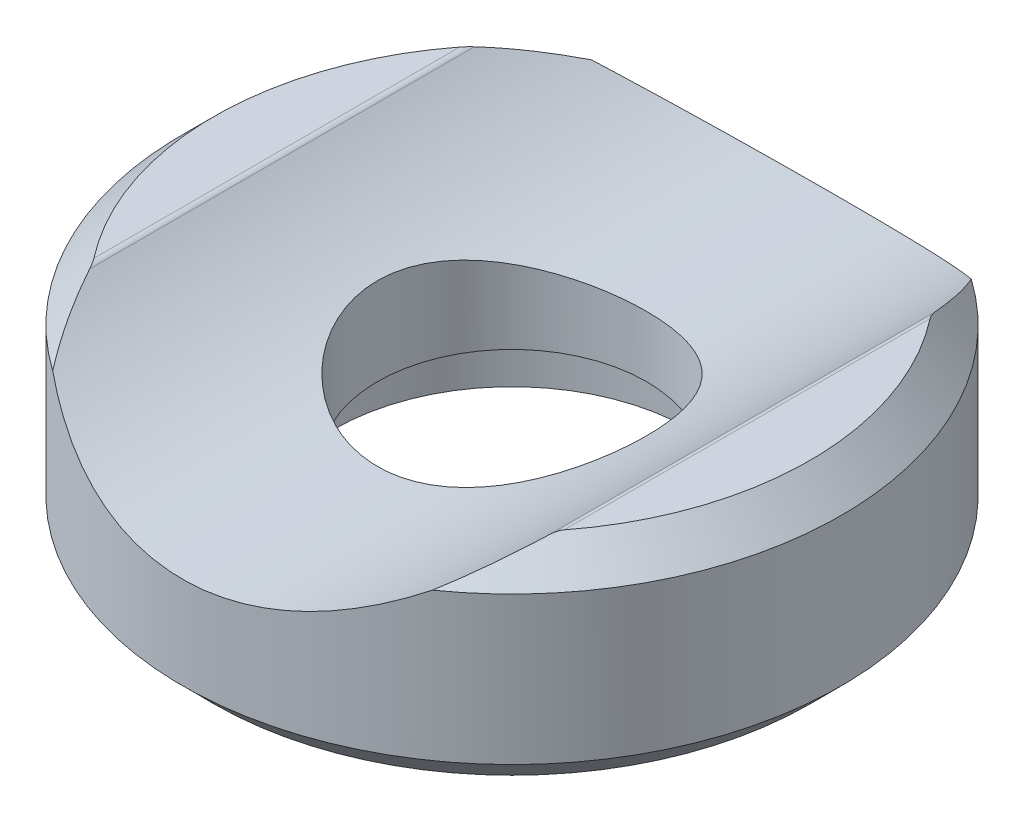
ISO-10303-21;
HEADER;
FILE_DESCRIPTION(('STEP AP214'),'2;1');
FILE_NAME('part.step','',(''),(''),'','','');
FILE_SCHEMA(('AUTOMOTIVE_DESIGN { 1 0 10303 214 1 1 1 1 }'));
ENDSEC;
DATA;
#1=APPLICATION_CONTEXT('core data for automotive mechanical design processes');
#2=APPLICATION_PROTOCOL_DEFINITION('international standard','automotive_design',2000,#1);
#3=PRODUCT_CONTEXT('',#1,'mechanical');
#4=PRODUCT('Part','Part','',(#3));
#5=PRODUCT_RELATED_PRODUCT_CATEGORY('part','',(#4));
#6=PRODUCT_DEFINITION_FORMATION('','',#4);
#7=PRODUCT_DEFINITION_CONTEXT('part definition',#1,'design');
#8=PRODUCT_DEFINITION('design','',#6,#7);
#9=PRODUCT_DEFINITION_SHAPE('','',#8);
#10=(LENGTH_UNIT() NAMED_UNIT(*) SI_UNIT(.MILLI.,.METRE.));
#11=(NAMED_UNIT(*) PLANE_ANGLE_UNIT() SI_UNIT($,.RADIAN.));
#12=(NAMED_UNIT(*) SI_UNIT($,.STERADIAN.) SOLID_ANGLE_UNIT());
#13=UNCERTAINTY_MEASURE_WITH_UNIT(LENGTH_MEASURE(1.E-05),#10,'distance_accuracy_value','');
#14=(GEOMETRIC_REPRESENTATION_CONTEXT(3) GLOBAL_UNCERTAINTY_ASSIGNED_CONTEXT((#13)) GLOBAL_UNIT_ASSIGNED_CONTEXT((#10,
#11,#12)) REPRESENTATION_CONTEXT('',''));
#15=CARTESIAN_POINT('',(0.,0.,0.));
#16=DIRECTION('',(0.,0.,1.));
#17=DIRECTION('',(1.,0.,0.));
#18=AXIS2_PLACEMENT_3D('',#15,#16,#17);
#19=CARTESIAN_POINT('',(0.,1.39999999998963,0.));
#20=DIRECTION('',(0.,-1.,0.));
#21=DIRECTION('',(0.,0.,-1.));
#22=AXIS2_PLACEMENT_3D('',#19,#20,#21);
#23=CONICAL_SURFACE('',#22,6.75000000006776,1.02974425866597);
#24=CARTESIAN_POINT('',(0.,2.39142002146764,0.));
#25=DIRECTION('',(0.,-1.,0.));
#26=DIRECTION('',(0.,0.,-1.));
#27=AXIS2_PLACEMENT_3D('',#24,#25,#26);
#28=CIRCLE('',#27,5.09999999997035);
#29=CARTESIAN_POINT('',(0.,2.39142002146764,-5.09999999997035));
#30=VERTEX_POINT('',#29);
#31=EDGE_CURVE('E87',#30,#30,#28,.F.);
#32=ORIENTED_EDGE('',*,*,#31,.T.);
#33=EDGE_LOOP('',(#32));
#34=FACE_BOUND('',#33,.T.);
#35=CARTESIAN_POINT('',(0.,1.4,0.));
#36=DIRECTION('',(0.,-1.,0.));
#37=DIRECTION('',(0.,0.,-1.));
#38=AXIS2_PLACEMENT_3D('',#35,#36,#37);
#39=CIRCLE('',#38,6.75);
#40=CARTESIAN_POINT('',(0.,1.4,-6.75));
#41=VERTEX_POINT('',#40);
#42=EDGE_CURVE('E192',#41,#41,#39,.T.);
#43=ORIENTED_EDGE('',*,*,#42,.T.);
#44=EDGE_LOOP('',(#43));
#45=FACE_BOUND('',#44,.T.);
#46=ADVANCED_FACE('F14',(#34,#45),#23,.F.);
#47=CARTESIAN_POINT('',(0.,0.,0.));
#48=DIRECTION('',(0.,-1.,0.));
#49=DIRECTION('',(0.,0.,-1.));
#50=AXIS2_PLACEMENT_3D('',#47,#48,#49);
#51=CYLINDRICAL_SURFACE('',#50,6.75);
#52=ORIENTED_EDGE('',*,*,#42,.F.);
#53=EDGE_LOOP('',(#52));
#54=FACE_BOUND('',#53,.T.);
#55=CARTESIAN_POINT('',(0.,0.,0.));
#56=DIRECTION('',(0.,-1.,0.));
#57=DIRECTION('',(0.,0.,-1.));
#58=AXIS2_PLACEMENT_3D('',#55,#56,#57);
#59=CIRCLE('',#58,6.75);
#60=CARTESIAN_POINT('',(0.,0.,-6.75));
#61=VERTEX_POINT('',#60);
#62=EDGE_CURVE('E86',#61,#61,#59,.F.);
#63=ORIENTED_EDGE('',*,*,#62,.F.);
#64=EDGE_LOOP('',(#63));
#65=FACE_BOUND('',#64,.T.);
#66=ADVANCED_FACE('F247',(#54,#65),#51,.F.);
#67=CARTESIAN_POINT('',(11.3,8.,0.));
#68=DIRECTION('',(0.,1.,0.));
#69=DIRECTION('',(0.,0.,1.));
#70=AXIS2_PLACEMENT_3D('',#67,#68,#69);
#71=PLANE('',#70);
#72=CARTESIAN_POINT('',(0.,8.,0.));
#73=DIRECTION('',(0.,-1.,0.));
#74=DIRECTION('',(1.,0.,0.));
#75=AXIS2_PLACEMENT_3D('',#72,#73,#74);
#76=CIRCLE('',#75,11.3);
#77=CARTESIAN_POINT('',(8.91795940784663,8.,-6.93974062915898));
#78=VERTEX_POINT('',#77);
#79=CARTESIAN_POINT('',(8.91795940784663,8.,6.93974062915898));
#80=VERTEX_POINT('',#79);
#81=EDGE_CURVE('E159',#78,#80,#76,.T.);
#82=ORIENTED_EDGE('',*,*,#81,.F.);
#83=DIRECTION('',(0.,0.,-1.));
#84=VECTOR('',#83,1.);
#85=CARTESIAN_POINT('',(8.91795940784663,8.,13.5));
#86=LINE('',#85,#84);
#87=EDGE_CURVE('E82',#80,#78,#86,.T.);
#88=ORIENTED_EDGE('',*,*,#87,.F.);
#89=EDGE_LOOP('',(#82,#88));
#90=FACE_BOUND('',#89,.T.);
#91=ADVANCED_FACE('F140',(#90),#71,.T.);
#92=CARTESIAN_POINT('',(8.91795940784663,7.7,13.5));
#93=DIRECTION('',(0.,0.,-1.));
#94=DIRECTION('',(-1.,0.,0.));
#95=AXIS2_PLACEMENT_3D('',#92,#93,#94);
#96=CYLINDRICAL_SURFACE('',#95,0.299999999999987);
#97=CARTESIAN_POINT('',(8.72267562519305,7.92773722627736,-7.29680002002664));
#98=CARTESIAN_POINT('',(8.73265058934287,7.93626990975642,-7.27157785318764));
#99=CARTESIAN_POINT('',(8.74323335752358,7.94422852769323,-7.24638670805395));
#100=CARTESIAN_POINT('',(8.76573315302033,7.95886412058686,-7.19610944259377));
#101=CARTESIAN_POINT('',(8.77765504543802,7.96553616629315,-7.17102407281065));
#102=CARTESIAN_POINT('',(8.80262682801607,7.97728042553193,-7.12168908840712));
#103=CARTESIAN_POINT('',(8.81564953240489,7.98238184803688,-7.09743277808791));
#104=CARTESIAN_POINT('',(8.84316165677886,7.9908832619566,-7.04949336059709));
#105=CARTESIAN_POINT('',(8.85764848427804,7.99428619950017,-7.02580932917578));
#106=CARTESIAN_POINT('',(8.88008198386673,7.99768487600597,-6.99189778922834));
#107=CARTESIAN_POINT('',(8.88734314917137,7.99852841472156,-6.98130048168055));
#108=CARTESIAN_POINT('',(8.90231145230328,7.99968527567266,-6.96032544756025));
#109=CARTESIAN_POINT('',(8.91002043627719,7.99999621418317,-6.94994891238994));
#110=CARTESIAN_POINT('',(8.91795940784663,8.,-6.93974062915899));
#111=B_SPLINE_CURVE_WITH_KNOTS('',3,(#97,#98,#99,#100,#101,#102,#103,#104,#105,#106,#107,#108,
#109,#110),.UNSPECIFIED.,.F.,.F.,(4,2,2,2,2,2,4),(0.,0.0853087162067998,0.170938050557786,
0.25486242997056,0.338640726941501,0.377244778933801,0.416021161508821),.UNSPECIFIED.);
#112=CARTESIAN_POINT('',(8.72267562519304,7.92773722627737,-7.29680002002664));
#113=VERTEX_POINT('',#112);
#114=EDGE_CURVE('E152',#113,#78,#111,.T.);
#115=ORIENTED_EDGE('',*,*,#114,.F.);
#116=DIRECTION('',(0.,0.,-1.));
#117=VECTOR('',#116,1.);
#118=CARTESIAN_POINT('',(8.72267562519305,7.92773722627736,13.5));
#119=LINE('',#118,#117);
#120=CARTESIAN_POINT('',(8.72267562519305,7.92773722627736,7.29680002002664));
#121=VERTEX_POINT('',#120);
#122=EDGE_CURVE('E183',#113,#121,#119,.F.);
#123=ORIENTED_EDGE('',*,*,#122,.T.);
#124=CARTESIAN_POINT('',(8.91795940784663,8.,6.93974062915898));
#125=CARTESIAN_POINT('',(8.9046476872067,7.99997217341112,6.95689297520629));
#126=CARTESIAN_POINT('',(8.89196526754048,7.99911478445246,6.97448410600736));
#127=CARTESIAN_POINT('',(8.86772468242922,7.99602313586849,7.01026482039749));
#128=CARTESIAN_POINT('',(8.85616438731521,7.9937915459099,7.02845317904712));
#129=CARTESIAN_POINT('',(8.83410636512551,7.98826230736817,7.06501369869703));
#130=CARTESIAN_POINT('',(8.82359827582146,7.98497675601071,7.08338158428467));
#131=CARTESIAN_POINT('',(8.80340792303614,7.9774781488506,7.12038905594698));
#132=CARTESIAN_POINT('',(8.79372603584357,7.97326467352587,7.13902876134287));
#133=CARTESIAN_POINT('',(8.77305819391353,7.96299278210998,7.18065484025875));
#134=CARTESIAN_POINT('',(8.7622617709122,7.95673246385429,7.20368507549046));
#135=CARTESIAN_POINT('',(8.74168868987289,7.94306448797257,7.25006657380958));
#136=CARTESIAN_POINT('',(8.73191960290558,7.935649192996,7.27341895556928));
#137=CARTESIAN_POINT('',(8.72267562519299,7.92773722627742,7.29680002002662));
#138=B_SPLINE_CURVE_WITH_KNOTS('',3,(#124,#125,#126,#127,#128,#129,#130,#131,#132,#133,#134,
#135,#136,#137),.UNSPECIFIED.,.F.,.F.,(4,2,2,2,2,2,4),(0.,0.0650512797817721,0.129976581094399,
0.194181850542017,0.258416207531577,0.336950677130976,0.416028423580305),.UNSPECIFIED.);
#139=EDGE_CURVE('E144',#80,#121,#138,.T.);
#140=ORIENTED_EDGE('',*,*,#139,.F.);
#141=ORIENTED_EDGE('',*,*,#87,.T.);
#142=EDGE_LOOP('',(#115,#123,#140,#141));
#143=FACE_BOUND('',#142,.T.);
#144=ADVANCED_FACE('F133',(#143),#96,.T.);
#145=CARTESIAN_POINT('',(-8.91795940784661,7.7,13.5));
#146=DIRECTION('',(0.,0.,-1.));
#147=DIRECTION('',(-1.,0.,0.));
#148=AXIS2_PLACEMENT_3D('',#145,#146,#147);
#149=CYLINDRICAL_SURFACE('',#148,0.3);
#150=CARTESIAN_POINT('',(-8.91795940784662,8.,6.93974062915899));
#151=CARTESIAN_POINT('',(-8.90464768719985,7.99997217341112,6.9568929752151));
#152=CARTESIAN_POINT('',(-8.89196526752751,7.9991147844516,6.97448410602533));
#153=CARTESIAN_POINT('',(-8.8677246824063,7.99602313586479,7.01026482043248));
#154=CARTESIAN_POINT('',(-8.85616438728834,7.99379154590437,7.02845317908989));
#155=CARTESIAN_POINT('',(-8.83410636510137,7.98826230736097,7.06501369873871));
#156=CARTESIAN_POINT('',(-8.82359827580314,7.98497675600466,7.08338158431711));
#157=CARTESIAN_POINT('',(-8.8034079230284,7.97747814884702,7.12038905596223));
#158=CARTESIAN_POINT('',(-8.79372603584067,7.9732646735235,7.1390287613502));
#159=CARTESIAN_POINT('',(-8.77305818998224,7.96299278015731,7.18065484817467));
#160=CARTESIAN_POINT('',(-8.76226176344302,7.9567324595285,7.20368509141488));
#161=CARTESIAN_POINT('',(-8.74168867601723,7.94306447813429,7.25006660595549));
#162=CARTESIAN_POINT('',(-8.73191958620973,7.93564918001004,7.27341899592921));
#163=CARTESIAN_POINT('',(-8.72267560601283,7.92773720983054,7.29680006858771));
#164=B_SPLINE_CURVE_WITH_KNOTS('',3,(#150,#151,#152,#153,#154,#155,#156,#157,#158,#159,#160,
#161,#162,#163),.UNSPECIFIED.,.F.,.F.,(4,2,2,2,2,2,4),(0.,0.0650512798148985,0.129976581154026,
0.194181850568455,0.258416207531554,0.336950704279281,0.416028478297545),.UNSPECIFIED.);
#165=CARTESIAN_POINT('',(-8.91795940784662,8.,6.93974062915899));
#166=VERTEX_POINT('',#165);
#167=CARTESIAN_POINT('',(-8.7226756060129,7.92773720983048,7.29680006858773));
#168=VERTEX_POINT('',#167);
#169=EDGE_CURVE('E81',#166,#168,#164,.T.);
#170=ORIENTED_EDGE('',*,*,#169,.T.);
#171=DIRECTION('',(0.,0.,-1.));
#172=VECTOR('',#171,1.);
#173=CARTESIAN_POINT('',(-8.7226756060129,7.92773720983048,13.5));
#174=LINE('',#173,#172);
#175=CARTESIAN_POINT('',(-8.7226756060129,7.92773720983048,-7.29680006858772));
#176=VERTEX_POINT('',#175);
#177=EDGE_CURVE('E79',#168,#176,#174,.T.);
#178=ORIENTED_EDGE('',*,*,#177,.T.);
#179=CARTESIAN_POINT('',(-8.7226756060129,7.92773720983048,-7.29680006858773));
#180=CARTESIAN_POINT('',(-8.73265056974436,7.93626989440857,-7.27157790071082));
#181=CARTESIAN_POINT('',(-8.74323333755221,7.94422851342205,-7.24638675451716));
#182=CARTESIAN_POINT('',(-8.76573313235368,7.95886410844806,-7.19610948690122));
#183=CARTESIAN_POINT('',(-8.7776550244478,7.96553615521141,-7.17102411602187));
#184=CARTESIAN_POINT('',(-8.80262680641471,7.97728041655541,-7.12168912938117));
#185=CARTESIAN_POINT('',(-8.8156495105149,7.98238184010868,-7.09743281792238));
#186=CARTESIAN_POINT('',(-8.84316163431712,7.99088325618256,-7.04949339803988));
#187=CARTESIAN_POINT('',(-8.85764846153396,7.99428619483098,-7.02580936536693));
#188=CARTESIAN_POINT('',(-8.88008196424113,7.99768487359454,-6.99189781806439));
#189=CARTESIAN_POINT('',(-8.88734313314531,7.99852841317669,-6.9813005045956));
#190=CARTESIAN_POINT('',(-8.90231144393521,7.99968527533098,-6.96032545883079));
#191=CARTESIAN_POINT('',(-8.91002043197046,7.99999621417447,-6.94994891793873));
#192=CARTESIAN_POINT('',(-8.91795940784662,8.,-6.93974062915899));
#193=B_SPLINE_CURVE_WITH_KNOTS('',3,(#179,#180,#181,#182,#183,#184,#185,#186,#187,#188,#189,
#190,#191,#192),.UNSPECIFIED.,.F.,.F.,(4,2,2,2,2,2,4),(0.,0.0853087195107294,0.170938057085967,
0.25486243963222,0.338640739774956,0.3772448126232,0.41602121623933),.UNSPECIFIED.);
#194=CARTESIAN_POINT('',(-8.91795940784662,8.,-6.93974062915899));
#195=VERTEX_POINT('',#194);
#196=EDGE_CURVE('E17',#176,#195,#193,.T.);
#197=ORIENTED_EDGE('',*,*,#196,.T.);
#198=DIRECTION('',(0.,0.,1.));
#199=VECTOR('',#198,1.);
#200=CARTESIAN_POINT('',(-8.91795940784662,8.,0.));
#201=LINE('',#200,#199);
#202=EDGE_CURVE('E77',#166,#195,#201,.F.);
#203=ORIENTED_EDGE('',*,*,#202,.F.);
#204=EDGE_LOOP('',(#170,#178,#197,#203));
#205=FACE_BOUND('',#204,.T.);
#206=ADVANCED_FACE('F76',(#205),#149,.T.);
#207=CARTESIAN_POINT('',(0.,0.,0.));
#208=DIRECTION('',(0.,-1.,0.));
#209=DIRECTION('',(0.,0.,-1.));
#210=AXIS2_PLACEMENT_3D('',#207,#208,#209);
#211=CYLINDRICAL_SURFACE('',#210,5.1);
#212=CARTESIAN_POINT('',(-1.96818292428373,4.84533078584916,4.70491827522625));
#213=CARTESIAN_POINT('',(-2.23642241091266,4.88516022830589,4.59270933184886));
#214=CARTESIAN_POINT('',(-2.49416026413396,4.93181436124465,4.45787765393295));
#215=CARTESIAN_POINT('',(-2.98195488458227,5.0336251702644,4.1474789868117));
#216=CARTESIAN_POINT('',(-3.21200177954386,5.08878486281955,3.97189753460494));
#217=CARTESIAN_POINT('',(-3.63860335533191,5.20157968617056,3.58516599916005));
#218=CARTESIAN_POINT('',(-3.83519899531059,5.25921167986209,3.37406005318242));
#219=CARTESIAN_POINT('',(-4.19054293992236,5.37073813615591,2.92097500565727));
#220=CARTESIAN_POINT('',(-4.34929158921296,5.42463263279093,2.67899618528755));
#221=CARTESIAN_POINT('',(-4.55621619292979,5.49816157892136,2.29615882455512));
#222=CARTESIAN_POINT('',(-4.62028033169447,5.52157061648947,2.16438153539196));
#223=CARTESIAN_POINT('',(-4.73699221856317,5.5650574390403,1.89535373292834));
#224=CARTESIAN_POINT('',(-4.78964478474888,5.5851366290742,1.75810555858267));
#225=CARTESIAN_POINT('',(-4.88301098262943,5.6212695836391,1.47913561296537));
#226=CARTESIAN_POINT('',(-4.92372770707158,5.63732439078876,1.33741501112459));
#227=CARTESIAN_POINT('',(-4.99280398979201,5.66483636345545,1.05055465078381));
#228=CARTESIAN_POINT('',(-5.02116442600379,5.67629385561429,0.905415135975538));
#229=CARTESIAN_POINT('',(-5.06386291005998,5.69363917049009,0.621772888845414));
#230=CARTESIAN_POINT('',(-5.07894550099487,5.69982201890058,0.483399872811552));
#231=CARTESIAN_POINT('',(-5.09775028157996,5.70754070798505,0.205703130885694));
#232=CARTESIAN_POINT('',(-5.10146860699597,5.7090749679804,0.0663790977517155));
#233=CARTESIAN_POINT('',(-5.0974918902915,5.70743849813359,-0.211997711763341));
#234=CARTESIAN_POINT('',(-5.08980335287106,5.70427044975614,-0.351050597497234));
#235=CARTESIAN_POINT('',(-5.06310714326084,5.69334239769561,-0.627932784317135));
#236=CARTESIAN_POINT('',(-5.04409526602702,5.68558068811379,-0.765761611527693));
#237=CARTESIAN_POINT('',(-4.99605230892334,5.666171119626,-1.03298123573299));
#238=CARTESIAN_POINT('',(-4.96750809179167,5.65471287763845,-1.16247348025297));
#239=CARTESIAN_POINT('',(-4.90054592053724,5.62819439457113,-1.41851664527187));
#240=CARTESIAN_POINT('',(-4.86212452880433,5.61313289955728,-1.54506652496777));
#241=CARTESIAN_POINT('',(-4.73251571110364,5.56317632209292,-1.91905378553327));
#242=CARTESIAN_POINT('',(-4.62694555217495,5.5234928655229,-2.16103816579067));
#243=CARTESIAN_POINT('',(-4.37535486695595,5.43371383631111,-2.63466114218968));
#244=CARTESIAN_POINT('',(-4.22776882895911,5.38323916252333,-2.86538608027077));
#245=CARTESIAN_POINT('',(-3.89804144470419,5.27833474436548,-3.2999368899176));
#246=CARTESIAN_POINT('',(-3.71588704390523,5.22390351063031,-3.50375254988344));
#247=CARTESIAN_POINT('',(-3.41379283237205,5.14168665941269,-3.79171257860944));
#248=CARTESIAN_POINT('',(-3.30461355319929,5.11334832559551,-3.88723521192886));
#249=CARTESIAN_POINT('',(-3.07834292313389,5.05786248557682,-4.06876042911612));
#250=CARTESIAN_POINT('',(-2.9612543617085,5.03071456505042,-4.15476634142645));
#251=CARTESIAN_POINT('',(-2.71982007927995,4.97834438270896,-4.31667941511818));
#252=CARTESIAN_POINT('',(-2.59547147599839,4.95312289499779,-4.39258252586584));
#253=CARTESIAN_POINT('',(-2.34039296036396,4.90532737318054,-4.53362844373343));
#254=CARTESIAN_POINT('',(-2.20966587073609,4.88275218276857,-4.59877595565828));
#255=CARTESIAN_POINT('',(-1.94380210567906,4.84105652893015,-4.71726962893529));
#256=CARTESIAN_POINT('',(-1.80871272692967,4.82190816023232,-4.77071199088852));
#257=CARTESIAN_POINT('',(-1.53408621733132,4.78738490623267,-4.86597287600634));
#258=CARTESIAN_POINT('',(-1.39455099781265,4.77200842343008,-4.90779632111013));
#259=CARTESIAN_POINT('',(-1.11205802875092,4.74547087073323,-4.97941315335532));
#260=CARTESIAN_POINT('',(-0.969100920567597,4.73430901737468,-5.00920877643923));
#261=CARTESIAN_POINT('',(-0.68088385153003,4.7165311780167,-5.0564531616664));
#262=CARTESIAN_POINT('',(-0.535624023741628,4.70991493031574,-5.07390263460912));
#263=CARTESIAN_POINT('',(-0.252860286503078,4.70168515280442,-5.09557969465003));
#264=CARTESIAN_POINT('',(-0.11542055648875,4.69979243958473,-5.10054528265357));
#265=CARTESIAN_POINT('',(0.159452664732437,4.70024373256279,-5.09935967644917));
#266=CARTESIAN_POINT('',(0.296886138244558,4.70258916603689,-5.09320473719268));
#267=CARTESIAN_POINT('',(0.570606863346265,4.71145451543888,-5.06983889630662));
#268=CARTESIAN_POINT('',(0.706894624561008,4.71797246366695,-5.05263320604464));
#269=CARTESIAN_POINT('',(0.977443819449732,4.73500893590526,-5.00733717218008));
#270=CARTESIAN_POINT('',(1.11170447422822,4.74552895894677,-4.97924274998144));
#271=CARTESIAN_POINT('',(1.37440492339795,4.7700323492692,-4.91314162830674));
#272=CARTESIAN_POINT('',(1.50290776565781,4.78393790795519,-4.8753567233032));
#273=CARTESIAN_POINT('',(1.75621586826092,4.81496976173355,-4.78994788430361));
#274=CARTESIAN_POINT('',(1.88101980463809,4.83209719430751,-4.74232047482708));
#275=CARTESIAN_POINT('',(2.24866629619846,4.88770609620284,-4.58523519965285));
#276=CARTESIAN_POINT('',(2.4849558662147,4.9304349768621,-4.46152038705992));
#277=CARTESIAN_POINT('',(2.94465073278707,5.02533707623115,-4.17326599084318));
#278=CARTESIAN_POINT('',(3.16695804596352,5.07785516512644,-4.00710573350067));
#279=CARTESIAN_POINT('',(3.5815723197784,5.18573533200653,-3.64124950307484));
#280=CARTESIAN_POINT('',(3.77386703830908,5.24109855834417,-3.44153991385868));
#281=CARTESIAN_POINT('',(4.04089078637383,5.32343796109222,-3.11487453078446));
#282=CARTESIAN_POINT('',(4.12818733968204,5.35144771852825,-2.9982215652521));
#283=CARTESIAN_POINT('',(4.29262789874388,5.40587414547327,-2.75763377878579));
#284=CARTESIAN_POINT('',(4.36977566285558,5.43229140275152,-2.63370167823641));
#285=CARTESIAN_POINT('',(4.5133606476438,5.48273501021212,-2.37927042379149));
#286=CARTESIAN_POINT('',(4.5797946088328,5.50676063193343,-2.24876928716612));
#287=CARTESIAN_POINT('',(4.70133990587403,5.55162959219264,-1.98213394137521));
#288=CARTESIAN_POINT('',(4.75645646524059,5.57247439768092,-1.84600236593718));
#289=CARTESIAN_POINT('',(4.85388439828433,5.60990482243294,-1.57179769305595));
#290=CARTESIAN_POINT('',(4.89643134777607,5.62656777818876,-1.43381894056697));
#291=CARTESIAN_POINT('',(4.96973445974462,5.65559178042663,-1.15437971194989));
#292=CARTESIAN_POINT('',(5.00049582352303,5.66795472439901,-1.01292080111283));
#293=CARTESIAN_POINT('',(5.04990472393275,5.68794237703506,-0.727610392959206));
#294=CARTESIAN_POINT('',(5.06855567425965,5.69556842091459,-0.583759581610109));
#295=CARTESIAN_POINT('',(5.09353576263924,5.7058046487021,-0.294817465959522));
#296=CARTESIAN_POINT('',(5.09986564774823,5.70841513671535,-0.149726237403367));
#297=CARTESIAN_POINT('',(5.10012098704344,5.70852061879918,0.130414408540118));
#298=CARTESIAN_POINT('',(5.09487470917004,5.70635718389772,0.265463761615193));
#299=CARTESIAN_POINT('',(5.0736972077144,5.69767247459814,0.534626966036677));
#300=CARTESIAN_POINT('',(5.05776242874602,5.69114975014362,0.668740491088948));
#301=CARTESIAN_POINT('',(5.01537499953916,5.67395741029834,0.934974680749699));
#302=CARTESIAN_POINT('',(4.98892589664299,5.66328919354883,1.06709600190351));
#303=CARTESIAN_POINT('',(4.92575739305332,5.63813544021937,1.32853653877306));
#304=CARTESIAN_POINT('',(4.88903406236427,5.6236484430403,1.45785466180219));
#305=CARTESIAN_POINT('',(4.80589100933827,5.59138751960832,1.71207097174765));
#306=CARTESIAN_POINT('',(4.75952891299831,5.5736331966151,1.83699048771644));
#307=CARTESIAN_POINT('',(4.65736083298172,5.5352889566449,2.08247217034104));
#308=CARTESIAN_POINT('',(4.60155149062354,5.51469803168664,2.20303276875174));
#309=CARTESIAN_POINT('',(4.42055728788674,5.44950029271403,2.55711484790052));
#310=CARTESIAN_POINT('',(4.28174919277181,5.4014453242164,2.78320981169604));
#311=CARTESIAN_POINT('',(3.96115414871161,5.29767916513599,3.22469022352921));
#312=CARTESIAN_POINT('',(3.77712661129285,5.24167153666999,3.43836971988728));
#313=CARTESIAN_POINT('',(3.37622880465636,5.13063971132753,3.83277230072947));
#314=CARTESIAN_POINT('',(3.15934876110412,5.07561581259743,4.01348554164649));
#315=CARTESIAN_POINT('',(2.68893675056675,4.97027115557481,4.34340780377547));
#316=CARTESIAN_POINT('',(2.43433400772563,4.92020471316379,4.49117837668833));
#317=CARTESIAN_POINT('',(1.90168970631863,4.83288812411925,4.74131307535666));
#318=CARTESIAN_POINT('',(1.62365663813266,4.79563335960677,4.84369356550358));
#319=CARTESIAN_POINT('',(1.06437277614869,4.73950877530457,4.99575016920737));
#320=CARTESIAN_POINT('',(0.783747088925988,4.71993278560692,5.0474584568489));
#321=CARTESIAN_POINT('',(0.217163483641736,4.69876444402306,5.10331383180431));
#322=CARTESIAN_POINT('',(-0.0687928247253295,4.69716674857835,5.10747505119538));
#323=CARTESIAN_POINT('',(-0.631092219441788,4.71197302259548,5.06848648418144));
#324=CARTESIAN_POINT('',(-0.907512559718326,4.72801172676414,5.02629668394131));
#325=CARTESIAN_POINT('',(-1.44851748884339,4.77575028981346,4.89787191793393));
#326=CARTESIAN_POINT('',(-1.71309862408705,4.80745468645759,4.81162418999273));
#327=CARTESIAN_POINT('',(-1.96818292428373,4.84533078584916,4.70491827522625));
#328=B_SPLINE_CURVE_WITH_KNOTS('',3,(#212,#213,#214,#215,#216,#217,#218,#219,#220,#221,#222,
#223,#224,#225,#226,#227,#228,#229,#230,#231,#232,#233,#234,#235,#236,#237,#238,#239,#240,#241,
#242,#243,#244,#245,#246,#247,#248,#249,#250,#251,#252,#253,#254,#255,#256,#257,#258,#259,#260,
#261,#262,#263,#264,#265,#266,#267,#268,#269,#270,#271,#272,#273,#274,#275,#276,#277,#278,#279,
#280,#281,#282,#283,#284,#285,#286,#287,#288,#289,#290,#291,#292,#293,#294,#295,#296,#297,#298,
#299,#300,#301,#302,#303,#304,#305,#306,#307,#308,#309,#310,#311,#312,#313,#314,#315,#316,#317,
#318,#319,#320,#321,#322,#323,#324,#325,#326,#327),.UNSPECIFIED.,.T.,.F.,(4,2,2,2,2,2,2,2,2,2,2,
2,2,2,2,2,2,2,2,2,2,2,2,2,2,2,2,2,2,2,2,2,2,2,2,2,2,2,2,2,2,2,2,2,2,2,2,2,2,2,2,2,2,2,2,2,2,4),
(0.,0.879368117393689,1.75904882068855,2.63764453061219,3.51623223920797,3.96090510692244,
4.40538986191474,4.84975934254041,5.29409724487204,5.71155291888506,6.1291505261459,
6.54651009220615,6.96402474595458,7.36284026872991,7.76179478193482,8.55907104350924,
9.39117390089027,10.2235916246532,10.6665856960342,11.1094243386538,11.5524400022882,
11.9952613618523,12.4342940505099,12.8731404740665,13.3119052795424,13.7506448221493,
14.1627637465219,14.5750214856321,14.9870849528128,15.3993029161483,15.802817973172,
16.20647575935,17.013138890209,17.8570322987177,18.7012690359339,19.1459308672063,
19.5904275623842,20.0350592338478,20.4794852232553,20.9149589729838,21.3502403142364,
21.7853989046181,22.2205311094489,22.6255448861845,23.0306934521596,23.435705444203,
23.8408725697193,24.2436836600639,24.6466382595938,25.4520022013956,26.3108026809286,
27.1698591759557,28.0611857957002,28.9521908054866,29.8057899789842,30.6591354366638,
31.4951346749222,32.3313762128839),.UNSPECIFIED.);
#329=CARTESIAN_POINT('',(-1.96818292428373,4.84533078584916,4.70491827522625));
#330=VERTEX_POINT('',#329);
#331=EDGE_CURVE('E198',#330,#330,#328,.F.);
#332=ORIENTED_EDGE('',*,*,#331,.T.);
#333=EDGE_LOOP('',(#332));
#334=FACE_BOUND('',#333,.T.);
#335=ORIENTED_EDGE('',*,*,#31,.F.);
#336=EDGE_LOOP('',(#335));
#337=FACE_BOUND('',#336,.T.);
#338=ADVANCED_FACE('F132',(#334,#337),#211,.F.);
#339=CARTESIAN_POINT('',(11.3,8.,0.));
#340=DIRECTION('',(0.,1.,0.));
#341=DIRECTION('',(0.,0.,1.));
#342=AXIS2_PLACEMENT_3D('',#339,#340,#341);
#343=PLANE('',#342);
#344=ORIENTED_EDGE('',*,*,#202,.T.);
#345=CARTESIAN_POINT('',(0.,8.,0.));
#346=DIRECTION('',(0.,-1.,0.));
#347=DIRECTION('',(1.,0.,0.));
#348=AXIS2_PLACEMENT_3D('',#345,#346,#347);
#349=CIRCLE('',#348,11.3);
#350=EDGE_CURVE('E85',#166,#195,#349,.T.);
#351=ORIENTED_EDGE('',*,*,#350,.F.);
#352=EDGE_LOOP('',(#344,#351));
#353=FACE_BOUND('',#352,.T.);
#354=ADVANCED_FACE('F84',(#353),#343,.T.);
#355=CARTESIAN_POINT('',(6.75,0.,0.));
#356=DIRECTION('',(0.,-1.,0.));
#357=DIRECTION('',(0.,0.,-1.));
#358=AXIS2_PLACEMENT_3D('',#355,#356,#357);
#359=PLANE('',#358);
#360=ORIENTED_EDGE('',*,*,#62,.T.);
#361=EDGE_LOOP('',(#360));
#362=FACE_BOUND('',#361,.T.);
#363=CARTESIAN_POINT('',(0.,0.,0.));
#364=DIRECTION('',(0.,1.,0.));
#365=DIRECTION('',(-1.,0.,0.));
#366=AXIS2_PLACEMENT_3D('',#363,#364,#365);
#367=CIRCLE('',#366,11.3);
#368=CARTESIAN_POINT('',(-11.3,0.,0.));
#369=VERTEX_POINT('',#368);
#370=EDGE_CURVE('E90',#369,#369,#367,.T.);
#371=ORIENTED_EDGE('',*,*,#370,.F.);
#372=EDGE_LOOP('',(#371));
#373=FACE_BOUND('',#372,.T.);
#374=ADVANCED_FACE('F165',(#362,#373),#359,.T.);
#375=CARTESIAN_POINT('',(0.,6.8,0.));
#376=DIRECTION('',(0.,-1.,0.));
#377=DIRECTION('',(1.,0.,0.));
#378=AXIS2_PLACEMENT_3D('',#375,#376,#377);
#379=CONICAL_SURFACE('',#378,12.5,0.785398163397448);
#380=ORIENTED_EDGE('',*,*,#139,.T.);
#381=CARTESIAN_POINT('',(8.72267562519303,7.92773722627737,7.29680002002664));
#382=CARTESIAN_POINT('',(8.62072544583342,7.84032634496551,7.55486582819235));
#383=CARTESIAN_POINT('',(8.51280833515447,7.75043579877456,7.80974871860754));
#384=CARTESIAN_POINT('',(8.28494667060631,7.56714512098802,8.31186611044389));
#385=CARTESIAN_POINT('',(8.16503526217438,7.47375508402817,8.55911934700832));
#386=CARTESIAN_POINT('',(7.91256552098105,7.28444571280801,9.04605439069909));
#387=CARTESIAN_POINT('',(7.78000904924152,7.18852675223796,9.28573730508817));
#388=CARTESIAN_POINT('',(7.50132177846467,6.99509462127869,9.75738410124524));
#389=CARTESIAN_POINT('',(7.35515531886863,6.89757784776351,9.98932541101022));
#390=CARTESIAN_POINT('',(7.20208303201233,6.8,10.2166530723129));
#391=B_SPLINE_CURVE_WITH_KNOTS('',3,(#381,#382,#383,#384,#385,#386,#387,#388,#389,#390),
.UNSPECIFIED.,.F.,.F.,(4,2,2,2,4),(0.,0.872678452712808,1.74300865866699,2.61321097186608,
3.48576122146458),.UNSPECIFIED.);
#392=CARTESIAN_POINT('',(7.20208303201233,6.8,10.2166530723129));
#393=VERTEX_POINT('',#392);
#394=EDGE_CURVE('E178',#121,#393,#391,.T.);
#395=ORIENTED_EDGE('',*,*,#394,.T.);
#396=CARTESIAN_POINT('',(0.,6.8,0.));
#397=DIRECTION('',(0.,-1.,0.));
#398=DIRECTION('',(0.,0.,-1.));
#399=AXIS2_PLACEMENT_3D('',#396,#397,#398);
#400=CIRCLE('',#399,12.5);
#401=CARTESIAN_POINT('',(7.20208303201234,6.8,-10.2166530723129));
#402=VERTEX_POINT('',#401);
#403=EDGE_CURVE('E196',#402,#393,#400,.T.);
#404=ORIENTED_EDGE('',*,*,#403,.F.);
#405=CARTESIAN_POINT('',(7.20208303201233,6.8,-10.2166530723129));
#406=CARTESIAN_POINT('',(7.35515531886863,6.89757784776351,-9.98932541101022));
#407=CARTESIAN_POINT('',(7.50132177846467,6.99509462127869,-9.75738410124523));
#408=CARTESIAN_POINT('',(7.78000904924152,7.18852675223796,-9.28573730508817));
#409=CARTESIAN_POINT('',(7.91256552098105,7.28444571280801,-9.04605439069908));
#410=CARTESIAN_POINT('',(8.16503526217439,7.47375508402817,-8.55911934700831));
#411=CARTESIAN_POINT('',(8.28494667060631,7.56714512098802,-8.31186611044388));
#412=CARTESIAN_POINT('',(8.51280833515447,7.75043579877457,-7.80974871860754));
#413=CARTESIAN_POINT('',(8.62072544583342,7.84032634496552,-7.55486582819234));
#414=CARTESIAN_POINT('',(8.72267562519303,7.92773722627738,-7.29680002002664));
#415=B_SPLINE_CURVE_WITH_KNOTS('',3,(#405,#406,#407,#408,#409,#410,#411,#412,#413,#414),
.UNSPECIFIED.,.F.,.F.,(4,2,2,2,4),(0.,0.872550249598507,1.74275256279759,2.61308276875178,
3.48576122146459),.UNSPECIFIED.);
#416=EDGE_CURVE('E171',#402,#113,#415,.T.);
#417=ORIENTED_EDGE('',*,*,#416,.T.);
#418=ORIENTED_EDGE('',*,*,#114,.T.);
#419=ORIENTED_EDGE('',*,*,#81,.T.);
#420=EDGE_LOOP('',(#380,#395,#404,#417,#418,#419));
#421=FACE_BOUND('',#420,.T.);
#422=ADVANCED_FACE('F161',(#421),#379,.T.);
#423=CARTESIAN_POINT('',(0.,18.1,13.5));
#424=DIRECTION('',(0.,0.,-1.));
#425=DIRECTION('',(-1.,0.,0.));
#426=AXIS2_PLACEMENT_3D('',#423,#424,#425);
#427=CYLINDRICAL_SURFACE('',#426,13.4);
#428=ORIENTED_EDGE('',*,*,#331,.F.);
#429=EDGE_LOOP('',(#428));
#430=FACE_BOUND('',#429,.T.);
#431=CARTESIAN_POINT('',(-7.20208303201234,6.8,-10.2166530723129));
#432=CARTESIAN_POINT('',(-6.98007205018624,6.65848902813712,-10.3731600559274));
#433=CARTESIAN_POINT('',(-6.75087664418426,6.52162464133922,-10.5238899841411));
#434=CARTESIAN_POINT('',(-6.27825046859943,6.25868606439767,-10.8125072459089));
#435=CARTESIAN_POINT('',(-6.03480519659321,6.13262320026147,-10.9503811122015));
#436=CARTESIAN_POINT('',(-5.53224032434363,5.89211128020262,-11.2127292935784));
#437=CARTESIAN_POINT('',(-5.27300941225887,5.77776494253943,-11.3370855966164));
#438=CARTESIAN_POINT('',(-4.74156918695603,5.56367082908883,-11.5694247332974));
#439=CARTESIAN_POINT('',(-4.46936371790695,5.46391876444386,-11.6774123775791));
#440=CARTESIAN_POINT('',(-3.91126546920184,5.28013776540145,-11.8760387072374));
#441=CARTESIAN_POINT('',(-3.62529378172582,5.1962176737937,-11.966557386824));
#442=CARTESIAN_POINT('',(-3.04307395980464,5.04664705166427,-12.1276923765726));
#443=CARTESIAN_POINT('',(-2.74682498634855,4.98099801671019,-12.1983070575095));
#444=CARTESIAN_POINT('',(-2.14750879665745,4.86970411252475,-12.3179222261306));
#445=CARTESIAN_POINT('',(-1.8444722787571,4.82398307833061,-12.3670050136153));
#446=CARTESIAN_POINT('',(-1.23323555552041,4.75332520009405,-12.4428259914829));
#447=CARTESIAN_POINT('',(-0.925036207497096,4.72838493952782,-12.4695678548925));
#448=CARTESIAN_POINT('',(-0.342882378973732,4.70160024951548,-12.4982853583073));
#449=CARTESIAN_POINT('',(-0.0691573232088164,4.69738724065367,-12.5028009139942));
#450=CARTESIAN_POINT('',(0.477730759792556,4.70572734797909,-12.4938602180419));
#451=CARTESIAN_POINT('',(0.75089382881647,4.71827916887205,-12.480405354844));
#452=CARTESIAN_POINT('',(1.29466981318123,4.75990073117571,-12.4357674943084));
#453=CARTESIAN_POINT('',(1.56528090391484,4.78898149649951,-12.4045726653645));
#454=CARTESIAN_POINT('',(2.1017416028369,4.86308174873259,-12.3250238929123));
#455=CARTESIAN_POINT('',(2.36759122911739,4.90810117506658,-12.2766700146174));
#456=CARTESIAN_POINT('',(2.87975542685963,5.0106217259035,-12.1664379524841));
#457=CARTESIAN_POINT('',(3.12638633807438,5.06739658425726,-12.1053456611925));
#458=CARTESIAN_POINT('',(3.61253177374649,5.19369475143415,-11.9692671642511));
#459=CARTESIAN_POINT('',(3.8520435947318,5.2632228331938,-11.8942757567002));
#460=CARTESIAN_POINT('',(4.32287836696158,5.41402945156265,-11.731359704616));
#461=CARTESIAN_POINT('',(4.55419922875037,5.49531095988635,-11.6434317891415));
#462=CARTESIAN_POINT('',(5.00784360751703,5.66856839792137,-11.455644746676));
#463=CARTESIAN_POINT('',(5.2301652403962,5.7605465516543,-11.3557831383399));
#464=CARTESIAN_POINT('',(5.76115685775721,5.9968304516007,-11.0986635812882));
#465=CARTESIAN_POINT('',(6.0646743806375,6.14632604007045,-10.9355135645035));
#466=CARTESIAN_POINT('',(6.64971558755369,6.4616353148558,-10.5899199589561));
#467=CARTESIAN_POINT('',(6.93131944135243,6.62738396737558,-10.407553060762));
#468=CARTESIAN_POINT('',(7.20208303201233,6.8,-10.2166530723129));
#469=B_SPLINE_CURVE_WITH_KNOTS('',3,(#431,#432,#433,#434,#435,#436,#437,#438,#439,#440,#441,
#442,#443,#444,#445,#446,#447,#448,#449,#450,#451,#452,#453,#454,#455,#456,#457,#458,#459,#460,
#461,#462,#463,#464,#465,#466,#467,#468),.UNSPECIFIED.,.F.,.F.,(4,2,2,2,2,2,2,2,2,2,2,2,2,2,2,2,
2,2,4),(0.,0.918834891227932,1.83862173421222,2.76588413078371,3.6928734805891,4.62602038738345,
5.55924365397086,6.48886817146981,7.41833982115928,8.23864434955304,9.05888550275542,
9.87967435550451,10.7004600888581,11.4807083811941,12.261249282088,13.0419878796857,
13.8228890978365,14.9481303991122,16.0690399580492),.UNSPECIFIED.);
#470=CARTESIAN_POINT('',(-7.20208303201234,6.8,-10.2166530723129));
#471=VERTEX_POINT('',#470);
#472=EDGE_CURVE('E93',#471,#402,#469,.T.);
#473=ORIENTED_EDGE('',*,*,#472,.F.);
#474=CARTESIAN_POINT('',(-8.72267560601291,7.92773720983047,-7.29680006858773));
#475=CARTESIAN_POINT('',(-8.62072542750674,7.8403263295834,-7.55486587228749));
#476=CARTESIAN_POINT('',(-8.51280831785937,7.75043578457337,-7.80974875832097));
#477=CARTESIAN_POINT('',(-8.28494665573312,7.5671451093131,-8.31186614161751));
#478=CARTESIAN_POINT('',(-8.16503524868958,7.47375507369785,-8.55911937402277));
#479=CARTESIAN_POINT('',(-7.91256551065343,7.28444570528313,-9.04605440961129));
#480=CARTESIAN_POINT('',(-7.78000904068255,7.1885267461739,-9.2857373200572));
#481=CARTESIAN_POINT('',(-7.50132177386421,6.99509461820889,-9.75738410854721));
#482=CARTESIAN_POINT('',(-7.35515531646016,6.89757784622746,-9.98932541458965));
#483=CARTESIAN_POINT('',(-7.20208303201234,6.8,-10.2166530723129));
#484=B_SPLINE_CURVE_WITH_KNOTS('',3,(#474,#475,#476,#477,#478,#479,#480,#481,#482,#483),
.UNSPECIFIED.,.F.,.F.,(4,2,2,2,4),(0.,0.872678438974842,1.74300863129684,2.61321093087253,
3.48576116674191),.UNSPECIFIED.);
#485=EDGE_CURVE('E95',#176,#471,#484,.T.);
#486=ORIENTED_EDGE('',*,*,#485,.F.);
#487=ORIENTED_EDGE('',*,*,#177,.F.);
#488=CARTESIAN_POINT('',(-7.20208303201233,6.8,10.2166530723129));
#489=CARTESIAN_POINT('',(-7.35515531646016,6.89757784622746,9.98932541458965));
#490=CARTESIAN_POINT('',(-7.5013217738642,6.99509461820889,9.75738410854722));
#491=CARTESIAN_POINT('',(-7.78000904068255,7.18852674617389,9.28573732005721));
#492=CARTESIAN_POINT('',(-7.91256551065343,7.28444570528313,9.04605440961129));
#493=CARTESIAN_POINT('',(-8.16503524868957,7.47375507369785,8.55911937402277));
#494=CARTESIAN_POINT('',(-8.28494665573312,7.5671451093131,8.31186614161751));
#495=CARTESIAN_POINT('',(-8.51280831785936,7.75043578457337,7.80974875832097));
#496=CARTESIAN_POINT('',(-8.62072542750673,7.84032632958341,7.55486587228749));
#497=CARTESIAN_POINT('',(-8.7226756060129,7.92773720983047,7.29680006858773));
#498=B_SPLINE_CURVE_WITH_KNOTS('',3,(#488,#489,#490,#491,#492,#493,#494,#495,#496,#497),
.UNSPECIFIED.,.F.,.F.,(4,2,2,2,4),(0.,0.872550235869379,1.74275253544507,2.61308272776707,
3.48576116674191),.UNSPECIFIED.);
#499=CARTESIAN_POINT('',(-7.20208303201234,6.8,10.2166530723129));
#500=VERTEX_POINT('',#499);
#501=EDGE_CURVE('E38',#500,#168,#498,.T.);
#502=ORIENTED_EDGE('',*,*,#501,.F.);
#503=CARTESIAN_POINT('',(7.20208303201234,6.8,10.2166530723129));
#504=CARTESIAN_POINT('',(6.98007205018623,6.65848902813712,10.3731600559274));
#505=CARTESIAN_POINT('',(6.75087664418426,6.52162464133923,10.5238899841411));
#506=CARTESIAN_POINT('',(6.27825046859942,6.25868606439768,10.8125072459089));
#507=CARTESIAN_POINT('',(6.03480519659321,6.13262320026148,10.9503811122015));
#508=CARTESIAN_POINT('',(5.53224032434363,5.89211128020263,11.2127292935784));
#509=CARTESIAN_POINT('',(5.27300941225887,5.77776494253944,11.3370855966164));
#510=CARTESIAN_POINT('',(4.74156918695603,5.56367082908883,11.5694247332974));
#511=CARTESIAN_POINT('',(4.46936371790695,5.46391876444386,11.6774123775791));
#512=CARTESIAN_POINT('',(3.91126546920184,5.28013776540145,11.8760387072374));
#513=CARTESIAN_POINT('',(3.62529378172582,5.1962176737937,11.966557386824));
#514=CARTESIAN_POINT('',(3.04307395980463,5.04664705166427,12.1276923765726));
#515=CARTESIAN_POINT('',(2.74682498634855,4.98099801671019,12.1983070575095));
#516=CARTESIAN_POINT('',(2.14750879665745,4.86970411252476,12.3179222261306));
#517=CARTESIAN_POINT('',(1.8444722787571,4.82398307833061,12.3670050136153));
#518=CARTESIAN_POINT('',(1.23323555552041,4.75332520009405,12.4428259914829));
#519=CARTESIAN_POINT('',(0.925036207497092,4.72838493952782,12.4695678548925));
#520=CARTESIAN_POINT('',(0.342882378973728,4.70160024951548,12.4982853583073));
#521=CARTESIAN_POINT('',(0.0691573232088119,4.69738724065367,12.5028009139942));
#522=CARTESIAN_POINT('',(-0.477730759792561,4.70572734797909,12.4938602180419));
#523=CARTESIAN_POINT('',(-0.750893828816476,4.71827916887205,12.480405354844));
#524=CARTESIAN_POINT('',(-1.29466981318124,4.75990073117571,12.4357674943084));
#525=CARTESIAN_POINT('',(-1.56528090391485,4.78898149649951,12.4045726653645));
#526=CARTESIAN_POINT('',(-2.10174160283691,4.86308174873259,12.3250238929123));
#527=CARTESIAN_POINT('',(-2.3675912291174,4.90810117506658,12.2766700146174));
#528=CARTESIAN_POINT('',(-2.87975542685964,5.0106217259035,12.1664379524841));
#529=CARTESIAN_POINT('',(-3.12638633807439,5.06739658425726,12.1053456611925));
#530=CARTESIAN_POINT('',(-3.6125317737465,5.19369475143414,11.9692671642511));
#531=CARTESIAN_POINT('',(-3.8520435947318,5.26322283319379,11.8942757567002));
#532=CARTESIAN_POINT('',(-4.32287836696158,5.41402945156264,11.731359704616));
#533=CARTESIAN_POINT('',(-4.55419922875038,5.49531095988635,11.6434317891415));
#534=CARTESIAN_POINT('',(-5.00784360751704,5.66856839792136,11.455644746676));
#535=CARTESIAN_POINT('',(-5.23016524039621,5.76054655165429,11.3557831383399));
#536=CARTESIAN_POINT('',(-5.76115685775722,5.99683045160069,11.0986635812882));
#537=CARTESIAN_POINT('',(-6.06467438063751,6.14632604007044,10.9355135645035));
#538=CARTESIAN_POINT('',(-6.64971558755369,6.4616353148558,10.5899199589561));
#539=CARTESIAN_POINT('',(-6.93131944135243,6.62738396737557,10.407553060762));
#540=CARTESIAN_POINT('',(-7.20208303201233,6.8,10.2166530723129));
#541=B_SPLINE_CURVE_WITH_KNOTS('',3,(#503,#504,#505,#506,#507,#508,#509,#510,#511,#512,#513,
#514,#515,#516,#517,#518,#519,#520,#521,#522,#523,#524,#525,#526,#527,#528,#529,#530,#531,#532,
#533,#534,#535,#536,#537,#538,#539,#540),.UNSPECIFIED.,.F.,.F.,(4,2,2,2,2,2,2,2,2,2,2,2,2,2,2,2,
2,2,4),(0.,0.918834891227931,1.83862173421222,2.76588413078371,3.6928734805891,4.62602038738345,
5.55924365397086,6.48886817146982,7.41833982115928,8.23864434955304,9.05888550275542,
9.87967435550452,10.7004600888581,11.4807083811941,12.261249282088,13.0419878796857,
13.8228890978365,14.9481303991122,16.0690399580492),.UNSPECIFIED.);
#542=EDGE_CURVE('E200',#393,#500,#541,.T.);
#543=ORIENTED_EDGE('',*,*,#542,.F.);
#544=ORIENTED_EDGE('',*,*,#394,.F.);
#545=ORIENTED_EDGE('',*,*,#122,.F.);
#546=ORIENTED_EDGE('',*,*,#416,.F.);
#547=EDGE_LOOP('',(#473,#486,#487,#502,#543,#544,#545,#546));
#548=FACE_BOUND('',#547,.T.);
#549=ADVANCED_FACE('F110',(#430,#548),#427,.F.);
#550=CARTESIAN_POINT('',(0.,6.8,0.));
#551=DIRECTION('',(0.,-1.,0.));
#552=DIRECTION('',(1.,0.,0.));
#553=AXIS2_PLACEMENT_3D('',#550,#551,#552);
#554=CONICAL_SURFACE('',#553,12.5,0.785398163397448);
#555=ORIENTED_EDGE('',*,*,#169,.F.);
#556=ORIENTED_EDGE('',*,*,#350,.T.);
#557=ORIENTED_EDGE('',*,*,#196,.F.);
#558=ORIENTED_EDGE('',*,*,#485,.T.);
#559=CARTESIAN_POINT('',(0.,6.8,0.));
#560=DIRECTION('',(0.,-1.,0.));
#561=DIRECTION('',(0.,0.,-1.));
#562=AXIS2_PLACEMENT_3D('',#559,#560,#561);
#563=CIRCLE('',#562,12.5);
#564=EDGE_CURVE('E29',#500,#471,#563,.T.);
#565=ORIENTED_EDGE('',*,*,#564,.F.);
#566=ORIENTED_EDGE('',*,*,#501,.T.);
#567=EDGE_LOOP('',(#555,#556,#557,#558,#565,#566));
#568=FACE_BOUND('',#567,.T.);
#569=ADVANCED_FACE('F89',(#568),#554,.T.);
#570=CARTESIAN_POINT('',(0.,1.2,0.));
#571=DIRECTION('',(0.,1.,0.));
#572=DIRECTION('',(-1.,0.,0.));
#573=AXIS2_PLACEMENT_3D('',#570,#571,#572);
#574=CONICAL_SURFACE('',#573,12.5,0.785398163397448);
#575=ORIENTED_EDGE('',*,*,#370,.T.);
#576=EDGE_LOOP('',(#575));
#577=FACE_BOUND('',#576,.T.);
#578=CARTESIAN_POINT('',(0.,1.2,0.));
#579=DIRECTION('',(0.,-1.,0.));
#580=DIRECTION('',(0.,0.,-1.));
#581=AXIS2_PLACEMENT_3D('',#578,#579,#580);
#582=CIRCLE('',#581,12.5);
#583=CARTESIAN_POINT('',(0.,1.2,-12.5));
#584=VERTEX_POINT('',#583);
#585=EDGE_CURVE('E9',#584,#584,#582,.F.);
#586=ORIENTED_EDGE('',*,*,#585,.F.);
#587=EDGE_LOOP('',(#586));
#588=FACE_BOUND('',#587,.T.);
#589=ADVANCED_FACE('F116',(#577,#588),#574,.T.);
#590=CARTESIAN_POINT('',(0.,0.,0.));
#591=DIRECTION('',(0.,-1.,0.));
#592=DIRECTION('',(0.,0.,-1.));
#593=AXIS2_PLACEMENT_3D('',#590,#591,#592);
#594=CYLINDRICAL_SURFACE('',#593,12.5);
#595=ORIENTED_EDGE('',*,*,#585,.T.);
#596=EDGE_LOOP('',(#595));
#597=FACE_BOUND('',#596,.T.);
#598=ORIENTED_EDGE('',*,*,#542,.T.);
#599=ORIENTED_EDGE('',*,*,#564,.T.);
#600=ORIENTED_EDGE('',*,*,#472,.T.);
#601=ORIENTED_EDGE('',*,*,#403,.T.);
#602=EDGE_LOOP('',(#598,#599,#600,#601));
#603=FACE_BOUND('',#602,.T.);
#604=ADVANCED_FACE('F204',(#597,#603),#594,.T.);
#605=CLOSED_SHELL('',(#46,#66,#91,#144,#206,#338,#354,#374,#422,#549,#569,#589,#604));
#606=MANIFOLD_SOLID_BREP('B1',#605);
#607=ADVANCED_BREP_SHAPE_REPRESENTATION('',(#18,#606),#14);
#608=SHAPE_DEFINITION_REPRESENTATION(#9,#607);
ENDSEC;
END-ISO-10303-21;
